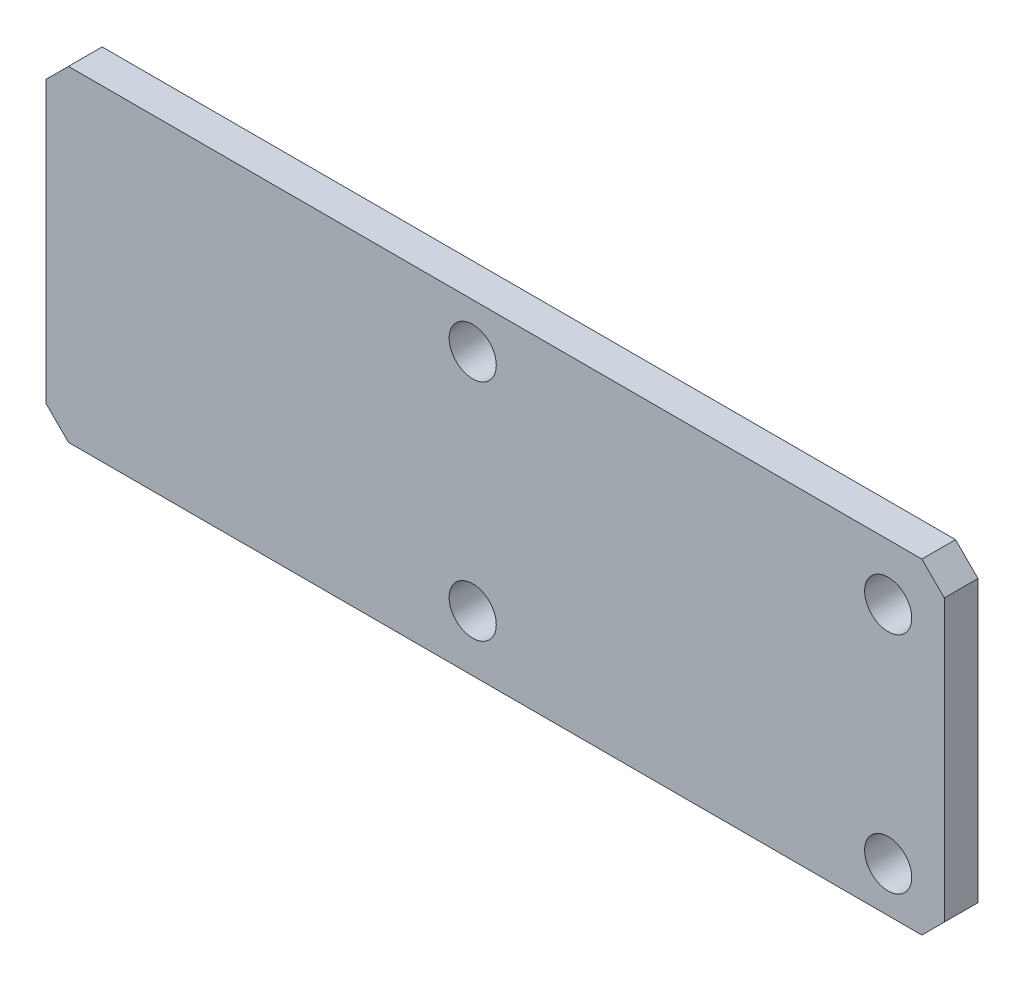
ISO-10303-21;
HEADER;
FILE_DESCRIPTION(('STEP AP214'),'2;1');
FILE_NAME('part.step','',(''),(''),'','','');
FILE_SCHEMA(('AUTOMOTIVE_DESIGN { 1 0 10303 214 1 1 1 1 }'));
ENDSEC;
DATA;
#1=APPLICATION_CONTEXT('core data for automotive mechanical design processes');
#2=APPLICATION_PROTOCOL_DEFINITION('international standard','automotive_design',2000,#1);
#3=PRODUCT_CONTEXT('',#1,'mechanical');
#4=PRODUCT('Part','Part','',(#3));
#5=PRODUCT_RELATED_PRODUCT_CATEGORY('part','',(#4));
#6=PRODUCT_DEFINITION_FORMATION('','',#4);
#7=PRODUCT_DEFINITION_CONTEXT('part definition',#1,'design');
#8=PRODUCT_DEFINITION('design','',#6,#7);
#9=PRODUCT_DEFINITION_SHAPE('','',#8);
#10=(LENGTH_UNIT() NAMED_UNIT(*) SI_UNIT(.MILLI.,.METRE.));
#11=(NAMED_UNIT(*) PLANE_ANGLE_UNIT() SI_UNIT($,.RADIAN.));
#12=(NAMED_UNIT(*) SI_UNIT($,.STERADIAN.) SOLID_ANGLE_UNIT());
#13=UNCERTAINTY_MEASURE_WITH_UNIT(LENGTH_MEASURE(1.E-05),#10,'distance_accuracy_value','');
#14=(GEOMETRIC_REPRESENTATION_CONTEXT(3) GLOBAL_UNCERTAINTY_ASSIGNED_CONTEXT((#13)) GLOBAL_UNIT_ASSIGNED_CONTEXT((#10,
#11,#12)) REPRESENTATION_CONTEXT('',''));
#15=CARTESIAN_POINT('',(0.,0.,0.));
#16=DIRECTION('',(0.,0.,1.));
#17=DIRECTION('',(1.,0.,0.));
#18=AXIS2_PLACEMENT_3D('',#15,#16,#17);
#19=CARTESIAN_POINT('',(-30.,-14.,3.));
#20=DIRECTION('',(0.,0.,1.));
#21=DIRECTION('',(1.,0.,0.));
#22=AXIS2_PLACEMENT_3D('',#19,#20,#21);
#23=PLANE('',#22);
#24=CARTESIAN_POINT('',(8.,11.,3.));
#25=DIRECTION('',(0.,0.,1.));
#26=DIRECTION('',(1.,0.,0.));
#27=AXIS2_PLACEMENT_3D('',#24,#25,#26);
#28=CIRCLE('',#27,2.1);
#29=CARTESIAN_POINT('',(10.1,11.,3.));
#30=VERTEX_POINT('',#29);
#31=EDGE_CURVE('E322',#30,#30,#28,.T.);
#32=ORIENTED_EDGE('',*,*,#31,.F.);
#33=EDGE_LOOP('',(#32));
#34=FACE_BOUND('',#33,.T.);
#35=CARTESIAN_POINT('',(45.,10.,3.));
#36=DIRECTION('',(0.,0.,1.));
#37=DIRECTION('',(1.,0.,0.));
#38=AXIS2_PLACEMENT_3D('',#35,#36,#37);
#39=CIRCLE('',#38,2.1);
#40=CARTESIAN_POINT('',(47.1,10.,3.));
#41=VERTEX_POINT('',#40);
#42=EDGE_CURVE('E135',#41,#41,#39,.T.);
#43=ORIENTED_EDGE('',*,*,#42,.F.);
#44=EDGE_LOOP('',(#43));
#45=FACE_BOUND('',#44,.T.);
#46=DIRECTION('',(0.,-1.,0.));
#47=VECTOR('',#46,1.);
#48=CARTESIAN_POINT('',(-30.,15.,3.));
#49=LINE('',#48,#47);
#50=CARTESIAN_POINT('',(-30.,13.,3.));
#51=VERTEX_POINT('',#50);
#52=CARTESIAN_POINT('',(-30.,-12.,3.));
#53=VERTEX_POINT('',#52);
#54=EDGE_CURVE('E140',#51,#53,#49,.T.);
#55=ORIENTED_EDGE('',*,*,#54,.T.);
#56=DIRECTION('',(-0.707106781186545,0.70710678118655,0.));
#57=VECTOR('',#56,1.);
#58=CARTESIAN_POINT('',(-29.,-13.,3.));
#59=LINE('',#58,#57);
#60=CARTESIAN_POINT('',(-28.,-14.,3.));
#61=VERTEX_POINT('',#60);
#62=EDGE_CURVE('E160',#53,#61,#59,.F.);
#63=ORIENTED_EDGE('',*,*,#62,.T.);
#64=DIRECTION('',(1.,0.,0.));
#65=VECTOR('',#64,1.);
#66=CARTESIAN_POINT('',(-30.,-14.,3.));
#67=LINE('',#66,#65);
#68=CARTESIAN_POINT('',(48.,-14.,3.));
#69=VERTEX_POINT('',#68);
#70=EDGE_CURVE('E121',#61,#69,#67,.T.);
#71=ORIENTED_EDGE('',*,*,#70,.T.);
#72=DIRECTION('',(-0.707106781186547,-0.707106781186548,0.));
#73=VECTOR('',#72,1.);
#74=CARTESIAN_POINT('',(9.00000000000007,-53.,3.));
#75=LINE('',#74,#73);
#76=CARTESIAN_POINT('',(50.,-12.,3.));
#77=VERTEX_POINT('',#76);
#78=EDGE_CURVE('E156',#69,#77,#75,.F.);
#79=ORIENTED_EDGE('',*,*,#78,.T.);
#80=DIRECTION('',(0.,1.,0.));
#81=VECTOR('',#80,1.);
#82=CARTESIAN_POINT('',(50.,15.,3.));
#83=LINE('',#82,#81);
#84=CARTESIAN_POINT('',(50.,13.,3.));
#85=VERTEX_POINT('',#84);
#86=EDGE_CURVE('E144',#77,#85,#83,.T.);
#87=ORIENTED_EDGE('',*,*,#86,.T.);
#88=DIRECTION('',(0.707106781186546,-0.707106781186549,0.));
#89=VECTOR('',#88,1.);
#90=CARTESIAN_POINT('',(23.5000000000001,39.5,3.));
#91=LINE('',#90,#89);
#92=CARTESIAN_POINT('',(48.,15.,3.));
#93=VERTEX_POINT('',#92);
#94=EDGE_CURVE('E56',#85,#93,#91,.F.);
#95=ORIENTED_EDGE('',*,*,#94,.T.);
#96=DIRECTION('',(-1.,0.,0.));
#97=VECTOR('',#96,1.);
#98=CARTESIAN_POINT('',(-30.,15.,3.));
#99=LINE('',#98,#97);
#100=CARTESIAN_POINT('',(-28.,15.,3.));
#101=VERTEX_POINT('',#100);
#102=EDGE_CURVE('E146',#93,#101,#99,.T.);
#103=ORIENTED_EDGE('',*,*,#102,.T.);
#104=DIRECTION('',(0.707106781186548,0.707106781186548,0.));
#105=VECTOR('',#104,1.);
#106=CARTESIAN_POINT('',(-43.5,-0.499999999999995,3.));
#107=LINE('',#106,#105);
#108=EDGE_CURVE('E158',#101,#51,#107,.F.);
#109=ORIENTED_EDGE('',*,*,#108,.T.);
#110=EDGE_LOOP('',(#55,#63,#71,#79,#87,#95,#103,#109));
#111=FACE_BOUND('',#110,.T.);
#112=CARTESIAN_POINT('',(45.,-10.,3.));
#113=DIRECTION('',(0.,0.,1.));
#114=DIRECTION('',(1.,0.,0.));
#115=AXIS2_PLACEMENT_3D('',#112,#113,#114);
#116=CIRCLE('',#115,2.1);
#117=CARTESIAN_POINT('',(47.1,-10.,3.));
#118=VERTEX_POINT('',#117);
#119=EDGE_CURVE('E314',#118,#118,#116,.T.);
#120=ORIENTED_EDGE('',*,*,#119,.F.);
#121=EDGE_LOOP('',(#120));
#122=FACE_BOUND('',#121,.T.);
#123=CARTESIAN_POINT('',(8.,-9.,3.));
#124=DIRECTION('',(0.,0.,1.));
#125=DIRECTION('',(1.,0.,0.));
#126=AXIS2_PLACEMENT_3D('',#123,#124,#125);
#127=CIRCLE('',#126,2.1);
#128=CARTESIAN_POINT('',(10.1,-9.,3.));
#129=VERTEX_POINT('',#128);
#130=EDGE_CURVE('E328',#129,#129,#127,.T.);
#131=ORIENTED_EDGE('',*,*,#130,.F.);
#132=EDGE_LOOP('',(#131));
#133=FACE_BOUND('',#132,.T.);
#134=ADVANCED_FACE('F34',(#34,#45,#111,#122,#133),#23,.T.);
#135=CARTESIAN_POINT('',(-30.,-14.,0.));
#136=DIRECTION('',(0.,0.,1.));
#137=DIRECTION('',(1.,0.,0.));
#138=AXIS2_PLACEMENT_3D('',#135,#136,#137);
#139=PLANE('',#138);
#140=CARTESIAN_POINT('',(8.,11.,0.));
#141=DIRECTION('',(0.,0.,1.));
#142=DIRECTION('',(1.,0.,0.));
#143=AXIS2_PLACEMENT_3D('',#140,#141,#142);
#144=CIRCLE('',#143,2.1);
#145=CARTESIAN_POINT('',(10.1,11.,0.));
#146=VERTEX_POINT('',#145);
#147=EDGE_CURVE('E325',#146,#146,#144,.T.);
#148=ORIENTED_EDGE('',*,*,#147,.T.);
#149=EDGE_LOOP('',(#148));
#150=FACE_BOUND('',#149,.T.);
#151=CARTESIAN_POINT('',(45.,10.,0.));
#152=DIRECTION('',(0.,0.,1.));
#153=DIRECTION('',(1.,0.,0.));
#154=AXIS2_PLACEMENT_3D('',#151,#152,#153);
#155=CIRCLE('',#154,2.1);
#156=CARTESIAN_POINT('',(47.1,10.,0.));
#157=VERTEX_POINT('',#156);
#158=EDGE_CURVE('E312',#157,#157,#155,.T.);
#159=ORIENTED_EDGE('',*,*,#158,.T.);
#160=EDGE_LOOP('',(#159));
#161=FACE_BOUND('',#160,.T.);
#162=DIRECTION('',(1.,0.,0.));
#163=VECTOR('',#162,1.);
#164=CARTESIAN_POINT('',(-30.,-14.,0.));
#165=LINE('',#164,#163);
#166=CARTESIAN_POINT('',(-28.,-14.,0.));
#167=VERTEX_POINT('',#166);
#168=CARTESIAN_POINT('',(48.,-14.,0.));
#169=VERTEX_POINT('',#168);
#170=EDGE_CURVE('E118',#167,#169,#165,.T.);
#171=ORIENTED_EDGE('',*,*,#170,.F.);
#172=DIRECTION('',(0.707106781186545,-0.70710678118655,0.));
#173=VECTOR('',#172,1.);
#174=CARTESIAN_POINT('',(-28.,-14.,0.));
#175=LINE('',#174,#173);
#176=CARTESIAN_POINT('',(-30.,-12.,0.));
#177=VERTEX_POINT('',#176);
#178=EDGE_CURVE('E101',#167,#177,#175,.F.);
#179=ORIENTED_EDGE('',*,*,#178,.T.);
#180=DIRECTION('',(0.,-1.,0.));
#181=VECTOR('',#180,1.);
#182=CARTESIAN_POINT('',(-30.,15.,0.));
#183=LINE('',#182,#181);
#184=CARTESIAN_POINT('',(-30.,13.,0.));
#185=VERTEX_POINT('',#184);
#186=EDGE_CURVE('E130',#185,#177,#183,.T.);
#187=ORIENTED_EDGE('',*,*,#186,.F.);
#188=DIRECTION('',(-0.707106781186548,-0.707106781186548,0.));
#189=VECTOR('',#188,1.);
#190=CARTESIAN_POINT('',(-30.,13.,0.));
#191=LINE('',#190,#189);
#192=CARTESIAN_POINT('',(-28.,15.,0.));
#193=VERTEX_POINT('',#192);
#194=EDGE_CURVE('E112',#185,#193,#191,.F.);
#195=ORIENTED_EDGE('',*,*,#194,.T.);
#196=DIRECTION('',(-1.,0.,0.));
#197=VECTOR('',#196,1.);
#198=CARTESIAN_POINT('',(-30.,15.,0.));
#199=LINE('',#198,#197);
#200=CARTESIAN_POINT('',(48.,15.,0.));
#201=VERTEX_POINT('',#200);
#202=EDGE_CURVE('E133',#201,#193,#199,.T.);
#203=ORIENTED_EDGE('',*,*,#202,.F.);
#204=DIRECTION('',(-0.707106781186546,0.707106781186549,0.));
#205=VECTOR('',#204,1.);
#206=CARTESIAN_POINT('',(48.,15.,0.));
#207=LINE('',#206,#205);
#208=CARTESIAN_POINT('',(50.,13.,0.));
#209=VERTEX_POINT('',#208);
#210=EDGE_CURVE('E122',#201,#209,#207,.F.);
#211=ORIENTED_EDGE('',*,*,#210,.T.);
#212=DIRECTION('',(0.,1.,0.));
#213=VECTOR('',#212,1.);
#214=CARTESIAN_POINT('',(50.,15.,0.));
#215=LINE('',#214,#213);
#216=CARTESIAN_POINT('',(50.,-12.,0.));
#217=VERTEX_POINT('',#216);
#218=EDGE_CURVE('E129',#217,#209,#215,.T.);
#219=ORIENTED_EDGE('',*,*,#218,.F.);
#220=DIRECTION('',(0.707106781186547,0.707106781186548,0.));
#221=VECTOR('',#220,1.);
#222=CARTESIAN_POINT('',(50.,-12.,0.));
#223=LINE('',#222,#221);
#224=EDGE_CURVE('E128',#217,#169,#223,.F.);
#225=ORIENTED_EDGE('',*,*,#224,.T.);
#226=EDGE_LOOP('',(#171,#179,#187,#195,#203,#211,#219,#225));
#227=FACE_BOUND('',#226,.T.);
#228=CARTESIAN_POINT('',(45.,-10.,0.));
#229=DIRECTION('',(0.,0.,1.));
#230=DIRECTION('',(1.,0.,0.));
#231=AXIS2_PLACEMENT_3D('',#228,#229,#230);
#232=CIRCLE('',#231,2.1);
#233=CARTESIAN_POINT('',(47.1,-10.,0.));
#234=VERTEX_POINT('',#233);
#235=EDGE_CURVE('E317',#234,#234,#232,.T.);
#236=ORIENTED_EDGE('',*,*,#235,.T.);
#237=EDGE_LOOP('',(#236));
#238=FACE_BOUND('',#237,.T.);
#239=CARTESIAN_POINT('',(8.,-9.,0.));
#240=DIRECTION('',(0.,0.,1.));
#241=DIRECTION('',(1.,0.,0.));
#242=AXIS2_PLACEMENT_3D('',#239,#240,#241);
#243=CIRCLE('',#242,2.1);
#244=CARTESIAN_POINT('',(10.1,-9.,0.));
#245=VERTEX_POINT('',#244);
#246=EDGE_CURVE('E331',#245,#245,#243,.T.);
#247=ORIENTED_EDGE('',*,*,#246,.T.);
#248=EDGE_LOOP('',(#247));
#249=FACE_BOUND('',#248,.T.);
#250=ADVANCED_FACE('F125',(#150,#161,#227,#238,#249),#139,.F.);
#251=CARTESIAN_POINT('',(-30.,15.,3.));
#252=DIRECTION('',(1.,0.,0.));
#253=DIRECTION('',(0.,1.,0.));
#254=AXIS2_PLACEMENT_3D('',#251,#252,#253);
#255=PLANE('',#254);
#256=ORIENTED_EDGE('',*,*,#186,.T.);
#257=DIRECTION('',(0.,0.,1.));
#258=VECTOR('',#257,1.);
#259=CARTESIAN_POINT('',(-30.,-12.,3.));
#260=LINE('',#259,#258);
#261=EDGE_CURVE('E106',#177,#53,#260,.T.);
#262=ORIENTED_EDGE('',*,*,#261,.T.);
#263=ORIENTED_EDGE('',*,*,#54,.F.);
#264=DIRECTION('',(0.,0.,-1.));
#265=VECTOR('',#264,1.);
#266=CARTESIAN_POINT('',(-30.,13.,3.));
#267=LINE('',#266,#265);
#268=EDGE_CURVE('E111',#51,#185,#267,.T.);
#269=ORIENTED_EDGE('',*,*,#268,.T.);
#270=EDGE_LOOP('',(#256,#262,#263,#269));
#271=FACE_BOUND('',#270,.T.);
#272=ADVANCED_FACE('F36',(#271),#255,.F.);
#273=CARTESIAN_POINT('',(-30.,-14.,3.));
#274=DIRECTION('',(0.,1.,0.));
#275=DIRECTION('',(0.,0.,1.));
#276=AXIS2_PLACEMENT_3D('',#273,#274,#275);
#277=PLANE('',#276);
#278=ORIENTED_EDGE('',*,*,#70,.F.);
#279=DIRECTION('',(0.,0.,-1.));
#280=VECTOR('',#279,1.);
#281=CARTESIAN_POINT('',(-28.,-14.,3.));
#282=LINE('',#281,#280);
#283=EDGE_CURVE('E105',#61,#167,#282,.T.);
#284=ORIENTED_EDGE('',*,*,#283,.T.);
#285=ORIENTED_EDGE('',*,*,#170,.T.);
#286=DIRECTION('',(0.,0.,1.));
#287=VECTOR('',#286,1.);
#288=CARTESIAN_POINT('',(48.,-14.,3.));
#289=LINE('',#288,#287);
#290=EDGE_CURVE('E123',#169,#69,#289,.T.);
#291=ORIENTED_EDGE('',*,*,#290,.T.);
#292=EDGE_LOOP('',(#278,#284,#285,#291));
#293=FACE_BOUND('',#292,.T.);
#294=ADVANCED_FACE('F117',(#293),#277,.F.);
#295=CARTESIAN_POINT('',(50.,15.,3.));
#296=DIRECTION('',(-1.,0.,0.));
#297=DIRECTION('',(0.,-1.,0.));
#298=AXIS2_PLACEMENT_3D('',#295,#296,#297);
#299=PLANE('',#298);
#300=ORIENTED_EDGE('',*,*,#86,.F.);
#301=DIRECTION('',(0.,0.,-1.));
#302=VECTOR('',#301,1.);
#303=CARTESIAN_POINT('',(50.,-12.,3.));
#304=LINE('',#303,#302);
#305=EDGE_CURVE('E11',#77,#217,#304,.T.);
#306=ORIENTED_EDGE('',*,*,#305,.T.);
#307=ORIENTED_EDGE('',*,*,#218,.T.);
#308=DIRECTION('',(0.,0.,1.));
#309=VECTOR('',#308,1.);
#310=CARTESIAN_POINT('',(50.,13.,3.));
#311=LINE('',#310,#309);
#312=EDGE_CURVE('E42',#209,#85,#311,.T.);
#313=ORIENTED_EDGE('',*,*,#312,.T.);
#314=EDGE_LOOP('',(#300,#306,#307,#313));
#315=FACE_BOUND('',#314,.T.);
#316=ADVANCED_FACE('F168',(#315),#299,.F.);
#317=CARTESIAN_POINT('',(-30.,15.,3.));
#318=DIRECTION('',(0.,-1.,0.));
#319=DIRECTION('',(0.,0.,-1.));
#320=AXIS2_PLACEMENT_3D('',#317,#318,#319);
#321=PLANE('',#320);
#322=ORIENTED_EDGE('',*,*,#202,.T.);
#323=DIRECTION('',(0.,0.,1.));
#324=VECTOR('',#323,1.);
#325=CARTESIAN_POINT('',(-28.,15.,3.));
#326=LINE('',#325,#324);
#327=EDGE_CURVE('E49',#193,#101,#326,.T.);
#328=ORIENTED_EDGE('',*,*,#327,.T.);
#329=ORIENTED_EDGE('',*,*,#102,.F.);
#330=DIRECTION('',(0.,0.,-1.));
#331=VECTOR('',#330,1.);
#332=CARTESIAN_POINT('',(48.,15.,3.));
#333=LINE('',#332,#331);
#334=EDGE_CURVE('E162',#93,#201,#333,.T.);
#335=ORIENTED_EDGE('',*,*,#334,.T.);
#336=EDGE_LOOP('',(#322,#328,#329,#335));
#337=FACE_BOUND('',#336,.T.);
#338=ADVANCED_FACE('F176',(#337),#321,.F.);
#339=CARTESIAN_POINT('',(45.,10.,3.));
#340=DIRECTION('',(0.,0.,-1.));
#341=DIRECTION('',(-1.,0.,0.));
#342=AXIS2_PLACEMENT_3D('',#339,#340,#341);
#343=CYLINDRICAL_SURFACE('',#342,2.1);
#344=ORIENTED_EDGE('',*,*,#42,.T.);
#345=EDGE_LOOP('',(#344));
#346=FACE_BOUND('',#345,.T.);
#347=ORIENTED_EDGE('',*,*,#158,.F.);
#348=EDGE_LOOP('',(#347));
#349=FACE_BOUND('',#348,.T.);
#350=ADVANCED_FACE('F207',(#346,#349),#343,.F.);
#351=CARTESIAN_POINT('',(45.,-10.,3.));
#352=DIRECTION('',(0.,0.,-1.));
#353=DIRECTION('',(-1.,0.,0.));
#354=AXIS2_PLACEMENT_3D('',#351,#352,#353);
#355=CYLINDRICAL_SURFACE('',#354,2.1);
#356=ORIENTED_EDGE('',*,*,#119,.T.);
#357=EDGE_LOOP('',(#356));
#358=FACE_BOUND('',#357,.T.);
#359=ORIENTED_EDGE('',*,*,#235,.F.);
#360=EDGE_LOOP('',(#359));
#361=FACE_BOUND('',#360,.T.);
#362=ADVANCED_FACE('F245',(#358,#361),#355,.F.);
#363=CARTESIAN_POINT('',(8.,11.,3.));
#364=DIRECTION('',(0.,0.,-1.));
#365=DIRECTION('',(-1.,0.,0.));
#366=AXIS2_PLACEMENT_3D('',#363,#364,#365);
#367=CYLINDRICAL_SURFACE('',#366,2.1);
#368=ORIENTED_EDGE('',*,*,#31,.T.);
#369=EDGE_LOOP('',(#368));
#370=FACE_BOUND('',#369,.T.);
#371=ORIENTED_EDGE('',*,*,#147,.F.);
#372=EDGE_LOOP('',(#371));
#373=FACE_BOUND('',#372,.T.);
#374=ADVANCED_FACE('F233',(#370,#373),#367,.F.);
#375=CARTESIAN_POINT('',(8.,-9.,3.));
#376=DIRECTION('',(0.,0.,-1.));
#377=DIRECTION('',(-1.,0.,0.));
#378=AXIS2_PLACEMENT_3D('',#375,#376,#377);
#379=CYLINDRICAL_SURFACE('',#378,2.1);
#380=ORIENTED_EDGE('',*,*,#130,.T.);
#381=EDGE_LOOP('',(#380));
#382=FACE_BOUND('',#381,.T.);
#383=ORIENTED_EDGE('',*,*,#246,.F.);
#384=EDGE_LOOP('',(#383));
#385=FACE_BOUND('',#384,.T.);
#386=ADVANCED_FACE('F228',(#382,#385),#379,.F.);
#387=CARTESIAN_POINT('',(-28.,-14.,3.));
#388=DIRECTION('',(0.70710678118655,0.707106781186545,0.));
#389=DIRECTION('',(-0.707106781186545,0.70710678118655,0.));
#390=AXIS2_PLACEMENT_3D('',#387,#388,#389);
#391=PLANE('',#390);
#392=ORIENTED_EDGE('',*,*,#62,.F.);
#393=ORIENTED_EDGE('',*,*,#261,.F.);
#394=ORIENTED_EDGE('',*,*,#178,.F.);
#395=ORIENTED_EDGE('',*,*,#283,.F.);
#396=EDGE_LOOP('',(#392,#393,#394,#395));
#397=FACE_BOUND('',#396,.T.);
#398=ADVANCED_FACE('F104',(#397),#391,.F.);
#399=CARTESIAN_POINT('',(-30.,13.,3.));
#400=DIRECTION('',(0.707106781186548,-0.707106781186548,0.));
#401=DIRECTION('',(0.707106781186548,0.707106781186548,0.));
#402=AXIS2_PLACEMENT_3D('',#399,#400,#401);
#403=PLANE('',#402);
#404=ORIENTED_EDGE('',*,*,#108,.F.);
#405=ORIENTED_EDGE('',*,*,#327,.F.);
#406=ORIENTED_EDGE('',*,*,#194,.F.);
#407=ORIENTED_EDGE('',*,*,#268,.F.);
#408=EDGE_LOOP('',(#404,#405,#406,#407));
#409=FACE_BOUND('',#408,.T.);
#410=ADVANCED_FACE('F180',(#409),#403,.F.);
#411=CARTESIAN_POINT('',(50.,-12.,3.));
#412=DIRECTION('',(-0.707106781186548,0.707106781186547,0.));
#413=DIRECTION('',(-0.707106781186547,-0.707106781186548,0.));
#414=AXIS2_PLACEMENT_3D('',#411,#412,#413);
#415=PLANE('',#414);
#416=ORIENTED_EDGE('',*,*,#78,.F.);
#417=ORIENTED_EDGE('',*,*,#290,.F.);
#418=ORIENTED_EDGE('',*,*,#224,.F.);
#419=ORIENTED_EDGE('',*,*,#305,.F.);
#420=EDGE_LOOP('',(#416,#417,#418,#419));
#421=FACE_BOUND('',#420,.T.);
#422=ADVANCED_FACE('F184',(#421),#415,.F.);
#423=CARTESIAN_POINT('',(48.,15.,3.));
#424=DIRECTION('',(-0.707106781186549,-0.707106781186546,0.));
#425=DIRECTION('',(0.707106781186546,-0.707106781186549,0.));
#426=AXIS2_PLACEMENT_3D('',#423,#424,#425);
#427=PLANE('',#426);
#428=ORIENTED_EDGE('',*,*,#94,.F.);
#429=ORIENTED_EDGE('',*,*,#312,.F.);
#430=ORIENTED_EDGE('',*,*,#210,.F.);
#431=ORIENTED_EDGE('',*,*,#334,.F.);
#432=EDGE_LOOP('',(#428,#429,#430,#431));
#433=FACE_BOUND('',#432,.T.);
#434=ADVANCED_FACE('F174',(#433),#427,.F.);
#435=CLOSED_SHELL('',(#134,#250,#272,#294,#316,#338,#350,#362,#374,#386,#398,#410,#422,#434));
#436=MANIFOLD_SOLID_BREP('B2',#435);
#437=ADVANCED_BREP_SHAPE_REPRESENTATION('',(#18,#436),#14);
#438=SHAPE_DEFINITION_REPRESENTATION(#9,#437);
ENDSEC;
END-ISO-10303-21;
